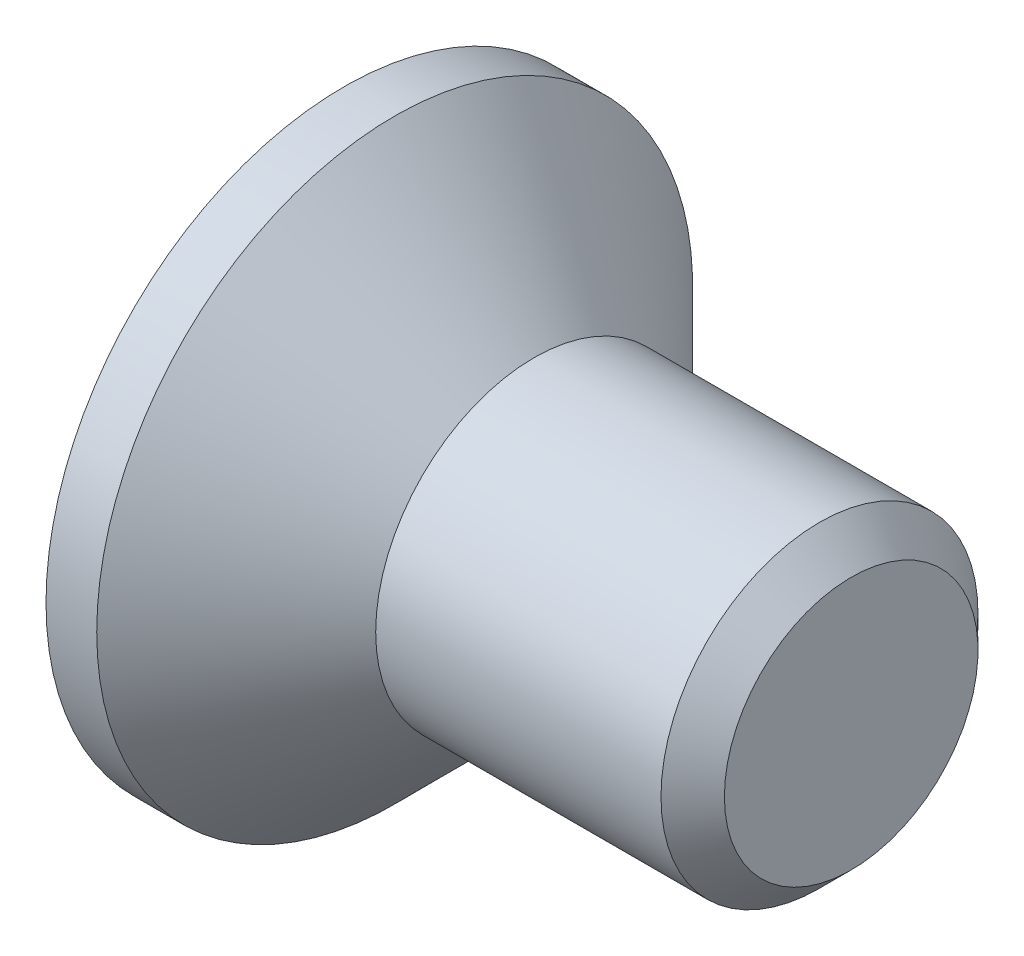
ISO-10303-21;
HEADER;
FILE_DESCRIPTION(('STEP AP214'),'2;1');
FILE_NAME('part.step','',(''),(''),'','','');
FILE_SCHEMA(('AUTOMOTIVE_DESIGN { 1 0 10303 214 1 1 1 1 }'));
ENDSEC;
DATA;
#1=APPLICATION_CONTEXT('core data for automotive mechanical design processes');
#2=APPLICATION_PROTOCOL_DEFINITION('international standard','automotive_design',2000,#1);
#3=PRODUCT_CONTEXT('',#1,'mechanical');
#4=PRODUCT('Part','Part','',(#3));
#5=PRODUCT_RELATED_PRODUCT_CATEGORY('part','',(#4));
#6=PRODUCT_DEFINITION_FORMATION('','',#4);
#7=PRODUCT_DEFINITION_CONTEXT('part definition',#1,'design');
#8=PRODUCT_DEFINITION('design','',#6,#7);
#9=PRODUCT_DEFINITION_SHAPE('','',#8);
#10=(LENGTH_UNIT() NAMED_UNIT(*) SI_UNIT(.MILLI.,.METRE.));
#11=(NAMED_UNIT(*) PLANE_ANGLE_UNIT() SI_UNIT($,.RADIAN.));
#12=(NAMED_UNIT(*) SI_UNIT($,.STERADIAN.) SOLID_ANGLE_UNIT());
#13=UNCERTAINTY_MEASURE_WITH_UNIT(LENGTH_MEASURE(1.E-05),#10,'distance_accuracy_value','');
#14=(GEOMETRIC_REPRESENTATION_CONTEXT(3) GLOBAL_UNCERTAINTY_ASSIGNED_CONTEXT((#13)) GLOBAL_UNIT_ASSIGNED_CONTEXT((#10,
#11,#12)) REPRESENTATION_CONTEXT('',''));
#15=CARTESIAN_POINT('',(0.,0.,0.));
#16=DIRECTION('',(0.,0.,1.));
#17=DIRECTION('',(1.,0.,0.));
#18=AXIS2_PLACEMENT_3D('',#15,#16,#17);
#19=CARTESIAN_POINT('',(0.,0.,0.));
#20=DIRECTION('',(-1.,0.,0.));
#21=DIRECTION('',(0.,0.,1.));
#22=AXIS2_PLACEMENT_3D('',#19,#20,#21);
#23=CONICAL_SURFACE('',#22,1.25,0.78539816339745);
#24=CARTESIAN_POINT('',(-1.1,0.,0.));
#25=DIRECTION('',(-1.,0.,0.));
#26=DIRECTION('',(0.,0.,1.));
#27=AXIS2_PLACEMENT_3D('',#24,#25,#26);
#28=CIRCLE('',#27,2.35);
#29=CARTESIAN_POINT('',(-1.1,0.,2.35));
#30=VERTEX_POINT('',#29);
#31=EDGE_CURVE('E189',#30,#30,#28,.T.);
#32=ORIENTED_EDGE('',*,*,#31,.F.);
#33=EDGE_LOOP('',(#32));
#34=FACE_BOUND('',#33,.T.);
#35=CARTESIAN_POINT('',(0.,0.,0.));
#36=DIRECTION('',(-1.,0.,0.));
#37=DIRECTION('',(0.,0.,1.));
#38=AXIS2_PLACEMENT_3D('',#35,#36,#37);
#39=CIRCLE('',#38,1.25);
#40=CARTESIAN_POINT('',(0.,0.,1.25));
#41=VERTEX_POINT('',#40);
#42=EDGE_CURVE('E212',#41,#41,#39,.T.);
#43=ORIENTED_EDGE('',*,*,#42,.T.);
#44=EDGE_LOOP('',(#43));
#45=FACE_BOUND('',#44,.T.);
#46=ADVANCED_FACE('F33',(#34,#45),#23,.T.);
#47=CARTESIAN_POINT('',(-1.5,0.,0.));
#48=DIRECTION('',(-1.,0.,0.));
#49=DIRECTION('',(0.,0.,1.));
#50=AXIS2_PLACEMENT_3D('',#47,#48,#49);
#51=CYLINDRICAL_SURFACE('',#50,1.25);
#52=CARTESIAN_POINT('',(2.25,0.,0.));
#53=DIRECTION('',(-1.,0.,0.));
#54=DIRECTION('',(0.,0.,1.));
#55=AXIS2_PLACEMENT_3D('',#52,#53,#54);
#56=CIRCLE('',#55,1.25);
#57=CARTESIAN_POINT('',(2.25,0.,1.25));
#58=VERTEX_POINT('',#57);
#59=EDGE_CURVE('E41',#58,#58,#56,.T.);
#60=ORIENTED_EDGE('',*,*,#59,.T.);
#61=EDGE_LOOP('',(#60));
#62=FACE_BOUND('',#61,.T.);
#63=ORIENTED_EDGE('',*,*,#42,.F.);
#64=EDGE_LOOP('',(#63));
#65=FACE_BOUND('',#64,.T.);
#66=ADVANCED_FACE('F217',(#62,#65),#51,.T.);
#67=CARTESIAN_POINT('',(2.5,0.,0.));
#68=DIRECTION('',(-1.,0.,0.));
#69=DIRECTION('',(0.,0.,1.));
#70=AXIS2_PLACEMENT_3D('',#67,#68,#69);
#71=PLANE('',#70);
#72=CARTESIAN_POINT('',(2.5,0.,0.));
#73=DIRECTION('',(-1.,0.,0.));
#74=DIRECTION('',(0.,0.,1.));
#75=AXIS2_PLACEMENT_3D('',#72,#73,#74);
#76=CIRCLE('',#75,1.);
#77=CARTESIAN_POINT('',(2.5,0.,1.));
#78=VERTEX_POINT('',#77);
#79=EDGE_CURVE('E11',#78,#78,#76,.F.);
#80=ORIENTED_EDGE('',*,*,#79,.T.);
#81=EDGE_LOOP('',(#80));
#82=FACE_BOUND('',#81,.T.);
#83=ADVANCED_FACE('F239',(#82),#71,.F.);
#84=CARTESIAN_POINT('',(-1.5,2.35,0.));
#85=DIRECTION('',(1.,0.,0.));
#86=DIRECTION('',(0.,0.,-1.));
#87=AXIS2_PLACEMENT_3D('',#84,#85,#86);
#88=PLANE('',#87);
#89=DIRECTION('',(0.,0.,-1.));
#90=VECTOR('',#89,1.);
#91=CARTESIAN_POINT('',(-1.5,0.34,-1.35));
#92=LINE('',#91,#90);
#93=CARTESIAN_POINT('',(-1.5,0.34,-0.34));
#94=VERTEX_POINT('',#93);
#95=CARTESIAN_POINT('',(-1.5,0.34,-1.35));
#96=VERTEX_POINT('',#95);
#97=EDGE_CURVE('E158',#94,#96,#92,.T.);
#98=ORIENTED_EDGE('',*,*,#97,.F.);
#99=DIRECTION('',(0.,-1.,0.));
#100=VECTOR('',#99,1.);
#101=CARTESIAN_POINT('',(-1.5,0.34,-0.34));
#102=LINE('',#101,#100);
#103=CARTESIAN_POINT('',(-1.5,1.35,-0.34));
#104=VERTEX_POINT('',#103);
#105=EDGE_CURVE('E48',#104,#94,#102,.T.);
#106=ORIENTED_EDGE('',*,*,#105,.F.);
#107=DIRECTION('',(0.,0.,-1.));
#108=VECTOR('',#107,1.);
#109=CARTESIAN_POINT('',(-1.5,1.35,-0.34));
#110=LINE('',#109,#108);
#111=CARTESIAN_POINT('',(-1.5,1.35,0.34));
#112=VERTEX_POINT('',#111);
#113=EDGE_CURVE('E185',#112,#104,#110,.T.);
#114=ORIENTED_EDGE('',*,*,#113,.F.);
#115=DIRECTION('',(0.,1.,0.));
#116=VECTOR('',#115,1.);
#117=CARTESIAN_POINT('',(-1.5,1.35,0.34));
#118=LINE('',#117,#116);
#119=CARTESIAN_POINT('',(-1.5,0.34,0.34));
#120=VERTEX_POINT('',#119);
#121=EDGE_CURVE('E183',#120,#112,#118,.T.);
#122=ORIENTED_EDGE('',*,*,#121,.F.);
#123=DIRECTION('',(0.,0.,-1.));
#124=VECTOR('',#123,1.);
#125=CARTESIAN_POINT('',(-1.5,0.34,0.34));
#126=LINE('',#125,#124);
#127=CARTESIAN_POINT('',(-1.5,0.34,1.35));
#128=VERTEX_POINT('',#127);
#129=EDGE_CURVE('E132',#128,#120,#126,.T.);
#130=ORIENTED_EDGE('',*,*,#129,.F.);
#131=DIRECTION('',(0.,1.,0.));
#132=VECTOR('',#131,1.);
#133=CARTESIAN_POINT('',(-1.5,0.34,1.35));
#134=LINE('',#133,#132);
#135=CARTESIAN_POINT('',(-1.5,-0.34,1.35));
#136=VERTEX_POINT('',#135);
#137=EDGE_CURVE('E179',#136,#128,#134,.T.);
#138=ORIENTED_EDGE('',*,*,#137,.F.);
#139=DIRECTION('',(0.,0.,1.));
#140=VECTOR('',#139,1.);
#141=CARTESIAN_POINT('',(-1.5,-0.34,1.35));
#142=LINE('',#141,#140);
#143=CARTESIAN_POINT('',(-1.5,-0.34,0.34));
#144=VERTEX_POINT('',#143);
#145=EDGE_CURVE('E176',#144,#136,#142,.T.);
#146=ORIENTED_EDGE('',*,*,#145,.F.);
#147=DIRECTION('',(0.,1.,0.));
#148=VECTOR('',#147,1.);
#149=CARTESIAN_POINT('',(-1.5,-0.34,0.34));
#150=LINE('',#149,#148);
#151=CARTESIAN_POINT('',(-1.5,-1.35,0.34));
#152=VERTEX_POINT('',#151);
#153=EDGE_CURVE('E173',#152,#144,#150,.T.);
#154=ORIENTED_EDGE('',*,*,#153,.F.);
#155=DIRECTION('',(0.,0.,1.));
#156=VECTOR('',#155,1.);
#157=CARTESIAN_POINT('',(-1.5,-1.35,0.34));
#158=LINE('',#157,#156);
#159=CARTESIAN_POINT('',(-1.5,-1.35,-0.34));
#160=VERTEX_POINT('',#159);
#161=EDGE_CURVE('E170',#160,#152,#158,.T.);
#162=ORIENTED_EDGE('',*,*,#161,.F.);
#163=DIRECTION('',(0.,-1.,0.));
#164=VECTOR('',#163,1.);
#165=CARTESIAN_POINT('',(-1.5,-1.35,-0.34));
#166=LINE('',#165,#164);
#167=CARTESIAN_POINT('',(-1.5,-0.34,-0.34));
#168=VERTEX_POINT('',#167);
#169=EDGE_CURVE('E167',#168,#160,#166,.T.);
#170=ORIENTED_EDGE('',*,*,#169,.F.);
#171=DIRECTION('',(0.,0.,1.));
#172=VECTOR('',#171,1.);
#173=CARTESIAN_POINT('',(-1.5,-0.34,-0.34));
#174=LINE('',#173,#172);
#175=CARTESIAN_POINT('',(-1.5,-0.34,-1.35));
#176=VERTEX_POINT('',#175);
#177=EDGE_CURVE('E164',#176,#168,#174,.T.);
#178=ORIENTED_EDGE('',*,*,#177,.F.);
#179=DIRECTION('',(0.,-1.,0.));
#180=VECTOR('',#179,1.);
#181=CARTESIAN_POINT('',(-1.5,-0.34,-1.35));
#182=LINE('',#181,#180);
#183=EDGE_CURVE('E161',#96,#176,#182,.T.);
#184=ORIENTED_EDGE('',*,*,#183,.F.);
#185=EDGE_LOOP('',(#98,#106,#114,#122,#130,#138,#146,#154,#162,#170,#178,#184));
#186=FACE_BOUND('',#185,.T.);
#187=CARTESIAN_POINT('',(-1.5,0.,0.));
#188=DIRECTION('',(-1.,0.,0.));
#189=DIRECTION('',(0.,0.,1.));
#190=AXIS2_PLACEMENT_3D('',#187,#188,#189);
#191=CIRCLE('',#190,2.35);
#192=CARTESIAN_POINT('',(-1.5,0.,2.35));
#193=VERTEX_POINT('',#192);
#194=EDGE_CURVE('E209',#193,#193,#191,.T.);
#195=ORIENTED_EDGE('',*,*,#194,.T.);
#196=EDGE_LOOP('',(#195));
#197=FACE_BOUND('',#196,.T.);
#198=ADVANCED_FACE('F230',(#186,#197),#88,.F.);
#199=CARTESIAN_POINT('',(-1.5,0.,0.));
#200=DIRECTION('',(-1.,0.,0.));
#201=DIRECTION('',(0.,0.,1.));
#202=AXIS2_PLACEMENT_3D('',#199,#200,#201);
#203=CYLINDRICAL_SURFACE('',#202,2.35);
#204=ORIENTED_EDGE('',*,*,#194,.F.);
#205=EDGE_LOOP('',(#204));
#206=FACE_BOUND('',#205,.T.);
#207=ORIENTED_EDGE('',*,*,#31,.T.);
#208=EDGE_LOOP('',(#207));
#209=FACE_BOUND('',#208,.T.);
#210=ADVANCED_FACE('F222',(#206,#209),#203,.T.);
#211=CARTESIAN_POINT('',(2.25,0.,0.));
#212=DIRECTION('',(-1.,0.,0.));
#213=DIRECTION('',(0.,0.,1.));
#214=AXIS2_PLACEMENT_3D('',#211,#212,#213);
#215=CONICAL_SURFACE('',#214,1.25,0.785398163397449);
#216=ORIENTED_EDGE('',*,*,#79,.F.);
#217=EDGE_LOOP('',(#216));
#218=FACE_BOUND('',#217,.T.);
#219=ORIENTED_EDGE('',*,*,#59,.F.);
#220=EDGE_LOOP('',(#219));
#221=FACE_BOUND('',#220,.T.);
#222=ADVANCED_FACE('F35',(#218,#221),#215,.T.);
#223=CARTESIAN_POINT('',(-0.25,0.34,-0.34));
#224=DIRECTION('',(0.,0.,-1.));
#225=DIRECTION('',(-1.,0.,0.));
#226=AXIS2_PLACEMENT_3D('',#223,#224,#225);
#227=PLANE('',#226);
#228=ORIENTED_EDGE('',*,*,#105,.T.);
#229=DIRECTION('',(-1.,0.,0.));
#230=VECTOR('',#229,1.);
#231=CARTESIAN_POINT('',(-0.25,0.34,-0.34));
#232=LINE('',#231,#230);
#233=CARTESIAN_POINT('',(-0.25,0.34,-0.34));
#234=VERTEX_POINT('',#233);
#235=EDGE_CURVE('E96',#234,#94,#232,.T.);
#236=ORIENTED_EDGE('',*,*,#235,.F.);
#237=DIRECTION('',(0.,-1.,0.));
#238=VECTOR('',#237,1.);
#239=CARTESIAN_POINT('',(-0.25,0.34,-0.34));
#240=LINE('',#239,#238);
#241=CARTESIAN_POINT('',(-0.25,1.35,-0.34));
#242=VERTEX_POINT('',#241);
#243=EDGE_CURVE('E187',#242,#234,#240,.T.);
#244=ORIENTED_EDGE('',*,*,#243,.F.);
#245=DIRECTION('',(-1.,0.,0.));
#246=VECTOR('',#245,1.);
#247=CARTESIAN_POINT('',(-0.25,1.35,-0.34));
#248=LINE('',#247,#246);
#249=EDGE_CURVE('E56',#242,#104,#248,.T.);
#250=ORIENTED_EDGE('',*,*,#249,.T.);
#251=EDGE_LOOP('',(#228,#236,#244,#250));
#252=FACE_BOUND('',#251,.T.);
#253=ADVANCED_FACE('F221',(#252),#227,.F.);
#254=CARTESIAN_POINT('',(-0.25,1.35,-0.34));
#255=DIRECTION('',(0.,1.,0.));
#256=DIRECTION('',(-1.,0.,0.));
#257=AXIS2_PLACEMENT_3D('',#254,#255,#256);
#258=PLANE('',#257);
#259=ORIENTED_EDGE('',*,*,#113,.T.);
#260=ORIENTED_EDGE('',*,*,#249,.F.);
#261=DIRECTION('',(0.,0.,-1.));
#262=VECTOR('',#261,1.);
#263=CARTESIAN_POINT('',(-0.25,1.35,-0.34));
#264=LINE('',#263,#262);
#265=CARTESIAN_POINT('',(-0.25,1.35,0.34));
#266=VERTEX_POINT('',#265);
#267=EDGE_CURVE('E144',#266,#242,#264,.T.);
#268=ORIENTED_EDGE('',*,*,#267,.F.);
#269=DIRECTION('',(-1.,0.,0.));
#270=VECTOR('',#269,1.);
#271=CARTESIAN_POINT('',(-0.25,1.35,0.34));
#272=LINE('',#271,#270);
#273=EDGE_CURVE('E136',#266,#112,#272,.T.);
#274=ORIENTED_EDGE('',*,*,#273,.T.);
#275=EDGE_LOOP('',(#259,#260,#268,#274));
#276=FACE_BOUND('',#275,.T.);
#277=ADVANCED_FACE('F228',(#276),#258,.F.);
#278=CARTESIAN_POINT('',(-0.25,1.35,0.34));
#279=DIRECTION('',(0.,0.,1.));
#280=DIRECTION('',(1.,0.,0.));
#281=AXIS2_PLACEMENT_3D('',#278,#279,#280);
#282=PLANE('',#281);
#283=ORIENTED_EDGE('',*,*,#121,.T.);
#284=ORIENTED_EDGE('',*,*,#273,.F.);
#285=DIRECTION('',(0.,1.,0.));
#286=VECTOR('',#285,1.);
#287=CARTESIAN_POINT('',(-0.25,1.35,0.34));
#288=LINE('',#287,#286);
#289=CARTESIAN_POINT('',(-0.25,0.34,0.34));
#290=VERTEX_POINT('',#289);
#291=EDGE_CURVE('E140',#290,#266,#288,.T.);
#292=ORIENTED_EDGE('',*,*,#291,.F.);
#293=DIRECTION('',(-1.,0.,0.));
#294=VECTOR('',#293,1.);
#295=CARTESIAN_POINT('',(-0.25,0.34,0.34));
#296=LINE('',#295,#294);
#297=EDGE_CURVE('E125',#290,#120,#296,.T.);
#298=ORIENTED_EDGE('',*,*,#297,.T.);
#299=EDGE_LOOP('',(#283,#284,#292,#298));
#300=FACE_BOUND('',#299,.T.);
#301=ADVANCED_FACE('F141',(#300),#282,.F.);
#302=CARTESIAN_POINT('',(-0.25,0.34,0.34));
#303=DIRECTION('',(0.,1.,0.));
#304=DIRECTION('',(-1.,0.,0.));
#305=AXIS2_PLACEMENT_3D('',#302,#303,#304);
#306=PLANE('',#305);
#307=ORIENTED_EDGE('',*,*,#129,.T.);
#308=ORIENTED_EDGE('',*,*,#297,.F.);
#309=DIRECTION('',(0.,0.,-1.));
#310=VECTOR('',#309,1.);
#311=CARTESIAN_POINT('',(-0.25,0.34,0.34));
#312=LINE('',#311,#310);
#313=CARTESIAN_POINT('',(-0.25,0.34,1.35));
#314=VERTEX_POINT('',#313);
#315=EDGE_CURVE('E129',#314,#290,#312,.T.);
#316=ORIENTED_EDGE('',*,*,#315,.F.);
#317=DIRECTION('',(-1.,0.,0.));
#318=VECTOR('',#317,1.);
#319=CARTESIAN_POINT('',(-0.25,0.34,1.35));
#320=LINE('',#319,#318);
#321=EDGE_CURVE('E137',#314,#128,#320,.T.);
#322=ORIENTED_EDGE('',*,*,#321,.T.);
#323=EDGE_LOOP('',(#307,#308,#316,#322));
#324=FACE_BOUND('',#323,.T.);
#325=ADVANCED_FACE('F127',(#324),#306,.F.);
#326=CARTESIAN_POINT('',(-0.25,0.34,1.35));
#327=DIRECTION('',(0.,0.,1.));
#328=DIRECTION('',(1.,0.,0.));
#329=AXIS2_PLACEMENT_3D('',#326,#327,#328);
#330=PLANE('',#329);
#331=ORIENTED_EDGE('',*,*,#137,.T.);
#332=ORIENTED_EDGE('',*,*,#321,.F.);
#333=DIRECTION('',(0.,1.,0.));
#334=VECTOR('',#333,1.);
#335=CARTESIAN_POINT('',(-0.25,0.34,1.35));
#336=LINE('',#335,#334);
#337=CARTESIAN_POINT('',(-0.25,-0.34,1.35));
#338=VERTEX_POINT('',#337);
#339=EDGE_CURVE('E150',#338,#314,#336,.T.);
#340=ORIENTED_EDGE('',*,*,#339,.F.);
#341=DIRECTION('',(-1.,0.,0.));
#342=VECTOR('',#341,1.);
#343=CARTESIAN_POINT('',(-0.25,-0.34,1.35));
#344=LINE('',#343,#342);
#345=EDGE_CURVE('E192',#338,#136,#344,.T.);
#346=ORIENTED_EDGE('',*,*,#345,.T.);
#347=EDGE_LOOP('',(#331,#332,#340,#346));
#348=FACE_BOUND('',#347,.T.);
#349=ADVANCED_FACE('F277',(#348),#330,.F.);
#350=CARTESIAN_POINT('',(-0.25,-0.34,1.35));
#351=DIRECTION('',(0.,-1.,0.));
#352=DIRECTION('',(1.,0.,0.));
#353=AXIS2_PLACEMENT_3D('',#350,#351,#352);
#354=PLANE('',#353);
#355=ORIENTED_EDGE('',*,*,#145,.T.);
#356=ORIENTED_EDGE('',*,*,#345,.F.);
#357=DIRECTION('',(0.,0.,1.));
#358=VECTOR('',#357,1.);
#359=CARTESIAN_POINT('',(-0.25,-0.34,1.35));
#360=LINE('',#359,#358);
#361=CARTESIAN_POINT('',(-0.25,-0.34,0.34));
#362=VERTEX_POINT('',#361);
#363=EDGE_CURVE('E152',#362,#338,#360,.T.);
#364=ORIENTED_EDGE('',*,*,#363,.F.);
#365=DIRECTION('',(-1.,0.,0.));
#366=VECTOR('',#365,1.);
#367=CARTESIAN_POINT('',(-0.25,-0.34,0.34));
#368=LINE('',#367,#366);
#369=EDGE_CURVE('E194',#362,#144,#368,.T.);
#370=ORIENTED_EDGE('',*,*,#369,.T.);
#371=EDGE_LOOP('',(#355,#356,#364,#370));
#372=FACE_BOUND('',#371,.T.);
#373=ADVANCED_FACE('F273',(#372),#354,.F.);
#374=CARTESIAN_POINT('',(-0.25,-0.34,0.34));
#375=DIRECTION('',(0.,0.,1.));
#376=DIRECTION('',(1.,0.,0.));
#377=AXIS2_PLACEMENT_3D('',#374,#375,#376);
#378=PLANE('',#377);
#379=ORIENTED_EDGE('',*,*,#153,.T.);
#380=ORIENTED_EDGE('',*,*,#369,.F.);
#381=DIRECTION('',(0.,1.,0.));
#382=VECTOR('',#381,1.);
#383=CARTESIAN_POINT('',(-0.25,-0.34,0.34));
#384=LINE('',#383,#382);
#385=CARTESIAN_POINT('',(-0.25,-1.35,0.34));
#386=VERTEX_POINT('',#385);
#387=EDGE_CURVE('E422',#386,#362,#384,.T.);
#388=ORIENTED_EDGE('',*,*,#387,.F.);
#389=DIRECTION('',(-1.,0.,0.));
#390=VECTOR('',#389,1.);
#391=CARTESIAN_POINT('',(-0.25,-1.35,0.34));
#392=LINE('',#391,#390);
#393=EDGE_CURVE('E196',#386,#152,#392,.T.);
#394=ORIENTED_EDGE('',*,*,#393,.T.);
#395=EDGE_LOOP('',(#379,#380,#388,#394));
#396=FACE_BOUND('',#395,.T.);
#397=ADVANCED_FACE('F269',(#396),#378,.F.);
#398=CARTESIAN_POINT('',(-0.25,-1.35,0.34));
#399=DIRECTION('',(0.,-1.,0.));
#400=DIRECTION('',(1.,0.,0.));
#401=AXIS2_PLACEMENT_3D('',#398,#399,#400);
#402=PLANE('',#401);
#403=ORIENTED_EDGE('',*,*,#161,.T.);
#404=ORIENTED_EDGE('',*,*,#393,.F.);
#405=DIRECTION('',(0.,0.,1.));
#406=VECTOR('',#405,1.);
#407=CARTESIAN_POINT('',(-0.25,-1.35,0.34));
#408=LINE('',#407,#406);
#409=CARTESIAN_POINT('',(-0.25,-1.35,-0.34));
#410=VERTEX_POINT('',#409);
#411=EDGE_CURVE('E419',#410,#386,#408,.T.);
#412=ORIENTED_EDGE('',*,*,#411,.F.);
#413=DIRECTION('',(-1.,0.,0.));
#414=VECTOR('',#413,1.);
#415=CARTESIAN_POINT('',(-0.25,-1.35,-0.34));
#416=LINE('',#415,#414);
#417=EDGE_CURVE('E198',#410,#160,#416,.T.);
#418=ORIENTED_EDGE('',*,*,#417,.T.);
#419=EDGE_LOOP('',(#403,#404,#412,#418));
#420=FACE_BOUND('',#419,.T.);
#421=ADVANCED_FACE('F265',(#420),#402,.F.);
#422=CARTESIAN_POINT('',(-0.25,-1.35,-0.34));
#423=DIRECTION('',(0.,0.,-1.));
#424=DIRECTION('',(-1.,0.,0.));
#425=AXIS2_PLACEMENT_3D('',#422,#423,#424);
#426=PLANE('',#425);
#427=ORIENTED_EDGE('',*,*,#169,.T.);
#428=ORIENTED_EDGE('',*,*,#417,.F.);
#429=DIRECTION('',(0.,-1.,0.));
#430=VECTOR('',#429,1.);
#431=CARTESIAN_POINT('',(-0.25,-1.35,-0.34));
#432=LINE('',#431,#430);
#433=CARTESIAN_POINT('',(-0.25,-0.34,-0.34));
#434=VERTEX_POINT('',#433);
#435=EDGE_CURVE('E416',#434,#410,#432,.T.);
#436=ORIENTED_EDGE('',*,*,#435,.F.);
#437=DIRECTION('',(-1.,0.,0.));
#438=VECTOR('',#437,1.);
#439=CARTESIAN_POINT('',(-0.25,-0.34,-0.34));
#440=LINE('',#439,#438);
#441=EDGE_CURVE('E200',#434,#168,#440,.T.);
#442=ORIENTED_EDGE('',*,*,#441,.T.);
#443=EDGE_LOOP('',(#427,#428,#436,#442));
#444=FACE_BOUND('',#443,.T.);
#445=ADVANCED_FACE('F261',(#444),#426,.F.);
#446=CARTESIAN_POINT('',(-0.25,-0.34,-0.34));
#447=DIRECTION('',(0.,-1.,0.));
#448=DIRECTION('',(1.,0.,0.));
#449=AXIS2_PLACEMENT_3D('',#446,#447,#448);
#450=PLANE('',#449);
#451=ORIENTED_EDGE('',*,*,#177,.T.);
#452=ORIENTED_EDGE('',*,*,#441,.F.);
#453=DIRECTION('',(0.,0.,1.));
#454=VECTOR('',#453,1.);
#455=CARTESIAN_POINT('',(-0.25,-0.34,-0.34));
#456=LINE('',#455,#454);
#457=CARTESIAN_POINT('',(-0.25,-0.34,-1.35));
#458=VERTEX_POINT('',#457);
#459=EDGE_CURVE('E413',#458,#434,#456,.T.);
#460=ORIENTED_EDGE('',*,*,#459,.F.);
#461=DIRECTION('',(-1.,0.,0.));
#462=VECTOR('',#461,1.);
#463=CARTESIAN_POINT('',(-0.25,-0.34,-1.35));
#464=LINE('',#463,#462);
#465=EDGE_CURVE('E202',#458,#176,#464,.T.);
#466=ORIENTED_EDGE('',*,*,#465,.T.);
#467=EDGE_LOOP('',(#451,#452,#460,#466));
#468=FACE_BOUND('',#467,.T.);
#469=ADVANCED_FACE('F257',(#468),#450,.F.);
#470=CARTESIAN_POINT('',(-0.25,-0.34,-1.35));
#471=DIRECTION('',(0.,0.,-1.));
#472=DIRECTION('',(-1.,0.,0.));
#473=AXIS2_PLACEMENT_3D('',#470,#471,#472);
#474=PLANE('',#473);
#475=ORIENTED_EDGE('',*,*,#183,.T.);
#476=ORIENTED_EDGE('',*,*,#465,.F.);
#477=DIRECTION('',(0.,-1.,0.));
#478=VECTOR('',#477,1.);
#479=CARTESIAN_POINT('',(-0.25,-0.34,-1.35));
#480=LINE('',#479,#478);
#481=CARTESIAN_POINT('',(-0.25,0.34,-1.35));
#482=VERTEX_POINT('',#481);
#483=EDGE_CURVE('E408',#482,#458,#480,.T.);
#484=ORIENTED_EDGE('',*,*,#483,.F.);
#485=DIRECTION('',(-1.,0.,0.));
#486=VECTOR('',#485,1.);
#487=CARTESIAN_POINT('',(-0.25,0.34,-1.35));
#488=LINE('',#487,#486);
#489=EDGE_CURVE('E204',#482,#96,#488,.T.);
#490=ORIENTED_EDGE('',*,*,#489,.T.);
#491=EDGE_LOOP('',(#475,#476,#484,#490));
#492=FACE_BOUND('',#491,.T.);
#493=ADVANCED_FACE('F253',(#492),#474,.F.);
#494=CARTESIAN_POINT('',(-0.25,0.34,-1.35));
#495=DIRECTION('',(0.,1.,0.));
#496=DIRECTION('',(-1.,0.,0.));
#497=AXIS2_PLACEMENT_3D('',#494,#495,#496);
#498=PLANE('',#497);
#499=ORIENTED_EDGE('',*,*,#97,.T.);
#500=ORIENTED_EDGE('',*,*,#489,.F.);
#501=DIRECTION('',(0.,0.,-1.));
#502=VECTOR('',#501,1.);
#503=CARTESIAN_POINT('',(-0.25,0.34,-1.35));
#504=LINE('',#503,#502);
#505=EDGE_CURVE('E406',#234,#482,#504,.T.);
#506=ORIENTED_EDGE('',*,*,#505,.F.);
#507=ORIENTED_EDGE('',*,*,#235,.T.);
#508=EDGE_LOOP('',(#499,#500,#506,#507));
#509=FACE_BOUND('',#508,.T.);
#510=ADVANCED_FACE('F250',(#509),#498,.F.);
#511=CARTESIAN_POINT('',(-0.25,0.,0.));
#512=DIRECTION('',(1.,0.,0.));
#513=DIRECTION('',(0.,0.,-1.));
#514=AXIS2_PLACEMENT_3D('',#511,#512,#513);
#515=PLANE('',#514);
#516=ORIENTED_EDGE('',*,*,#243,.T.);
#517=ORIENTED_EDGE('',*,*,#505,.T.);
#518=ORIENTED_EDGE('',*,*,#483,.T.);
#519=ORIENTED_EDGE('',*,*,#459,.T.);
#520=ORIENTED_EDGE('',*,*,#435,.T.);
#521=ORIENTED_EDGE('',*,*,#411,.T.);
#522=ORIENTED_EDGE('',*,*,#387,.T.);
#523=ORIENTED_EDGE('',*,*,#363,.T.);
#524=ORIENTED_EDGE('',*,*,#339,.T.);
#525=ORIENTED_EDGE('',*,*,#315,.T.);
#526=ORIENTED_EDGE('',*,*,#291,.T.);
#527=ORIENTED_EDGE('',*,*,#267,.T.);
#528=EDGE_LOOP('',(#516,#517,#518,#519,#520,#521,#522,#523,#524,#525,#526,#527));
#529=FACE_BOUND('',#528,.T.);
#530=ADVANCED_FACE('F147',(#529),#515,.F.);
#531=CLOSED_SHELL('',(#46,#66,#83,#198,#210,#222,#253,#277,#301,#325,#349,#373,#397,#421,#445,
#469,#493,#510,#530));
#532=MANIFOLD_SOLID_BREP('B2',#531);
#533=ADVANCED_BREP_SHAPE_REPRESENTATION('',(#18,#532),#14);
#534=SHAPE_DEFINITION_REPRESENTATION(#9,#533);
ENDSEC;
END-ISO-10303-21;
